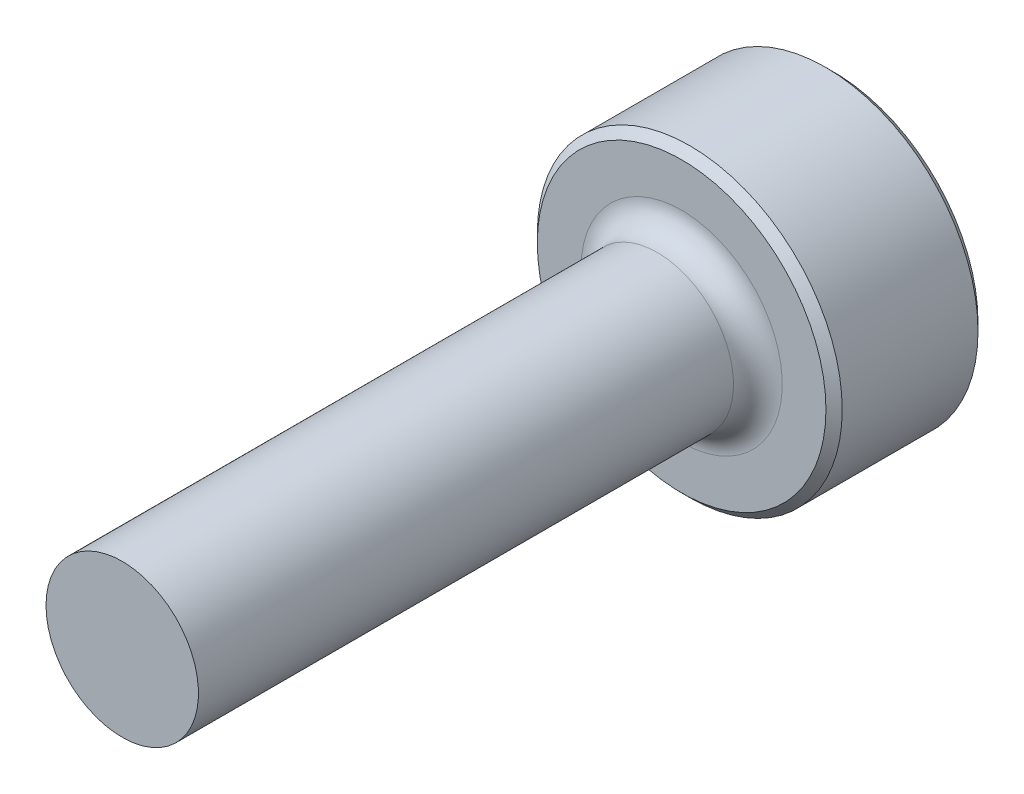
ISO-10303-21;
HEADER;
FILE_DESCRIPTION(('STEP AP214'),'2;1');
FILE_NAME('part.step','',(''),(''),'','','');
FILE_SCHEMA(('AUTOMOTIVE_DESIGN { 1 0 10303 214 1 1 1 1 }'));
ENDSEC;
DATA;
#1=APPLICATION_CONTEXT('core data for automotive mechanical design processes');
#2=APPLICATION_PROTOCOL_DEFINITION('international standard','automotive_design',2000,#1);
#3=PRODUCT_CONTEXT('',#1,'mechanical');
#4=PRODUCT('Part','Part','',(#3));
#5=PRODUCT_RELATED_PRODUCT_CATEGORY('part','',(#4));
#6=PRODUCT_DEFINITION_FORMATION('','',#4);
#7=PRODUCT_DEFINITION_CONTEXT('part definition',#1,'design');
#8=PRODUCT_DEFINITION('design','',#6,#7);
#9=PRODUCT_DEFINITION_SHAPE('','',#8);
#10=(LENGTH_UNIT() NAMED_UNIT(*) SI_UNIT(.MILLI.,.METRE.));
#11=(NAMED_UNIT(*) PLANE_ANGLE_UNIT() SI_UNIT($,.RADIAN.));
#12=(NAMED_UNIT(*) SI_UNIT($,.STERADIAN.) SOLID_ANGLE_UNIT());
#13=UNCERTAINTY_MEASURE_WITH_UNIT(LENGTH_MEASURE(1.E-05),#10,'distance_accuracy_value','');
#14=(GEOMETRIC_REPRESENTATION_CONTEXT(3) GLOBAL_UNCERTAINTY_ASSIGNED_CONTEXT((#13)) GLOBAL_UNIT_ASSIGNED_CONTEXT((#10,
#11,#12)) REPRESENTATION_CONTEXT('',''));
#15=CARTESIAN_POINT('',(0.,0.,0.));
#16=DIRECTION('',(0.,0.,1.));
#17=DIRECTION('',(1.,0.,0.));
#18=AXIS2_PLACEMENT_3D('',#15,#16,#17);
#19=CARTESIAN_POINT('',(0.,2.38124999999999,22.225));
#20=DIRECTION('',(0.,0.,1.));
#21=DIRECTION('',(1.,0.,0.));
#22=AXIS2_PLACEMENT_3D('',#19,#20,#21);
#23=PLANE('',#22);
#24=CARTESIAN_POINT('',(0.,0.,22.225));
#25=DIRECTION('',(0.,0.,-1.));
#26=DIRECTION('',(-1.,0.,0.));
#27=AXIS2_PLACEMENT_3D('',#24,#25,#26);
#28=CIRCLE('',#27,2.38124999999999);
#29=CARTESIAN_POINT('',(-2.38124999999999,0.,22.225));
#30=VERTEX_POINT('',#29);
#31=EDGE_CURVE('E50',#30,#30,#28,.T.);
#32=ORIENTED_EDGE('',*,*,#31,.F.);
#33=EDGE_LOOP('',(#32));
#34=FACE_BOUND('',#33,.T.);
#35=ADVANCED_FACE('F30',(#34),#23,.T.);
#36=CARTESIAN_POINT('',(0.,0.,-25.4347445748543));
#37=DIRECTION('',(0.,0.,-1.));
#38=DIRECTION('',(-1.,0.,0.));
#39=AXIS2_PLACEMENT_3D('',#36,#37,#38);
#40=CYLINDRICAL_SURFACE('',#39,2.38125);
#41=ORIENTED_EDGE('',*,*,#31,.T.);
#42=EDGE_LOOP('',(#41));
#43=FACE_BOUND('',#42,.T.);
#44=CARTESIAN_POINT('',(0.,0.,5.5118));
#45=DIRECTION('',(0.,0.,-1.));
#46=DIRECTION('',(-1.,0.,0.));
#47=AXIS2_PLACEMENT_3D('',#44,#45,#46);
#48=CIRCLE('',#47,2.38125);
#49=CARTESIAN_POINT('',(-2.38125,0.,5.5118));
#50=VERTEX_POINT('',#49);
#51=EDGE_CURVE('E53',#50,#50,#48,.T.);
#52=ORIENTED_EDGE('',*,*,#51,.F.);
#53=EDGE_LOOP('',(#52));
#54=FACE_BOUND('',#53,.T.);
#55=ADVANCED_FACE('F64',(#43,#54),#40,.T.);
#56=CARTESIAN_POINT('',(0.,0.,5.5118));
#57=DIRECTION('',(0.,0.,-1.));
#58=DIRECTION('',(-1.,0.,0.));
#59=AXIS2_PLACEMENT_3D('',#56,#57,#58);
#60=TOROIDAL_SURFACE('',#59,3.14325,0.762);
#61=ORIENTED_EDGE('',*,*,#51,.T.);
#62=EDGE_LOOP('',(#61));
#63=FACE_BOUND('',#62,.T.);
#64=CARTESIAN_POINT('',(0.,0.,4.7498));
#65=DIRECTION('',(0.,0.,-1.));
#66=DIRECTION('',(-1.,0.,0.));
#67=AXIS2_PLACEMENT_3D('',#64,#65,#66);
#68=CIRCLE('',#67,3.14325);
#69=CARTESIAN_POINT('',(-3.14325,0.,4.7498));
#70=VERTEX_POINT('',#69);
#71=EDGE_CURVE('E56',#70,#70,#68,.T.);
#72=ORIENTED_EDGE('',*,*,#71,.F.);
#73=EDGE_LOOP('',(#72));
#74=FACE_BOUND('',#73,.T.);
#75=ADVANCED_FACE('F62',(#63,#74),#60,.F.);
#76=CARTESIAN_POINT('',(0.,4.76249999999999,4.7498));
#77=DIRECTION('',(0.,0.,1.));
#78=DIRECTION('',(1.,0.,0.));
#79=AXIS2_PLACEMENT_3D('',#76,#77,#78);
#80=PLANE('',#79);
#81=CARTESIAN_POINT('',(0.,0.,4.7498));
#82=DIRECTION('',(0.,0.,1.));
#83=DIRECTION('',(1.,0.,0.));
#84=AXIS2_PLACEMENT_3D('',#81,#82,#83);
#85=CIRCLE('',#84,4.5085);
#86=CARTESIAN_POINT('',(4.5085,0.,4.7498));
#87=VERTEX_POINT('',#86);
#88=EDGE_CURVE('E10',#87,#87,#85,.T.);
#89=ORIENTED_EDGE('',*,*,#88,.T.);
#90=EDGE_LOOP('',(#89));
#91=FACE_BOUND('',#90,.T.);
#92=ORIENTED_EDGE('',*,*,#71,.T.);
#93=EDGE_LOOP('',(#92));
#94=FACE_BOUND('',#93,.T.);
#95=ADVANCED_FACE('F60',(#91,#94),#80,.T.);
#96=CARTESIAN_POINT('',(0.,0.,-25.4347445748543));
#97=DIRECTION('',(0.,0.,-1.));
#98=DIRECTION('',(-1.,0.,0.));
#99=AXIS2_PLACEMENT_3D('',#96,#97,#98);
#100=CYLINDRICAL_SURFACE('',#99,4.7625);
#101=CARTESIAN_POINT('',(0.,0.,0.254000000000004));
#102=DIRECTION('',(0.,0.,-1.));
#103=DIRECTION('',(-1.,0.,0.));
#104=AXIS2_PLACEMENT_3D('',#101,#102,#103);
#105=CIRCLE('',#104,4.7625);
#106=CARTESIAN_POINT('',(-4.7625,0.,0.254000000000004));
#107=VERTEX_POINT('',#106);
#108=EDGE_CURVE('E37',#107,#107,#105,.F.);
#109=ORIENTED_EDGE('',*,*,#108,.T.);
#110=EDGE_LOOP('',(#109));
#111=FACE_BOUND('',#110,.T.);
#112=CARTESIAN_POINT('',(0.,0.,4.4958));
#113=DIRECTION('',(0.,0.,1.));
#114=DIRECTION('',(1.,0.,0.));
#115=AXIS2_PLACEMENT_3D('',#112,#113,#114);
#116=CIRCLE('',#115,4.7625);
#117=CARTESIAN_POINT('',(4.7625,0.,4.4958));
#118=VERTEX_POINT('',#117);
#119=EDGE_CURVE('E41',#118,#118,#116,.F.);
#120=ORIENTED_EDGE('',*,*,#119,.T.);
#121=EDGE_LOOP('',(#120));
#122=FACE_BOUND('',#121,.T.);
#123=ADVANCED_FACE('F71',(#111,#122),#100,.T.);
#124=CARTESIAN_POINT('',(0.,0.,0.));
#125=DIRECTION('',(0.,0.,-1.));
#126=DIRECTION('',(-1.,0.,0.));
#127=AXIS2_PLACEMENT_3D('',#124,#125,#126);
#128=PLANE('',#127);
#129=CARTESIAN_POINT('',(0.,0.,0.));
#130=DIRECTION('',(0.,0.,-1.));
#131=DIRECTION('',(-1.,0.,0.));
#132=AXIS2_PLACEMENT_3D('',#129,#130,#131);
#133=CIRCLE('',#132,4.50849999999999);
#134=CARTESIAN_POINT('',(-4.50849999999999,0.,0.));
#135=VERTEX_POINT('',#134);
#136=EDGE_CURVE('E45',#135,#135,#133,.T.);
#137=ORIENTED_EDGE('',*,*,#136,.T.);
#138=EDGE_LOOP('',(#137));
#139=FACE_BOUND('',#138,.T.);
#140=ADVANCED_FACE('F83',(#139),#128,.T.);
#141=CARTESIAN_POINT('',(0.,0.,0.));
#142=DIRECTION('',(0.,0.,1.));
#143=DIRECTION('',(1.,0.,0.));
#144=AXIS2_PLACEMENT_3D('',#141,#142,#143);
#145=CONICAL_SURFACE('',#144,4.50849999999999,0.785398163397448);
#146=ORIENTED_EDGE('',*,*,#108,.F.);
#147=EDGE_LOOP('',(#146));
#148=FACE_BOUND('',#147,.T.);
#149=ORIENTED_EDGE('',*,*,#136,.F.);
#150=EDGE_LOOP('',(#149));
#151=FACE_BOUND('',#150,.T.);
#152=ADVANCED_FACE('F81',(#148,#151),#145,.T.);
#153=CARTESIAN_POINT('',(0.,0.,4.4958));
#154=DIRECTION('',(0.,0.,-1.));
#155=DIRECTION('',(-1.,0.,0.));
#156=AXIS2_PLACEMENT_3D('',#153,#154,#155);
#157=CONICAL_SURFACE('',#156,4.7625,0.785398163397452);
#158=ORIENTED_EDGE('',*,*,#88,.F.);
#159=EDGE_LOOP('',(#158));
#160=FACE_BOUND('',#159,.T.);
#161=ORIENTED_EDGE('',*,*,#119,.F.);
#162=EDGE_LOOP('',(#161));
#163=FACE_BOUND('',#162,.T.);
#164=ADVANCED_FACE('F32',(#160,#163),#157,.T.);
#165=CLOSED_SHELL('',(#35,#55,#75,#95,#123,#140,#152,#164));
#166=MANIFOLD_SOLID_BREP('B2',#165);
#167=ADVANCED_BREP_SHAPE_REPRESENTATION('',(#18,#166),#14);
#168=SHAPE_DEFINITION_REPRESENTATION(#9,#167);
ENDSEC;
END-ISO-10303-21;
